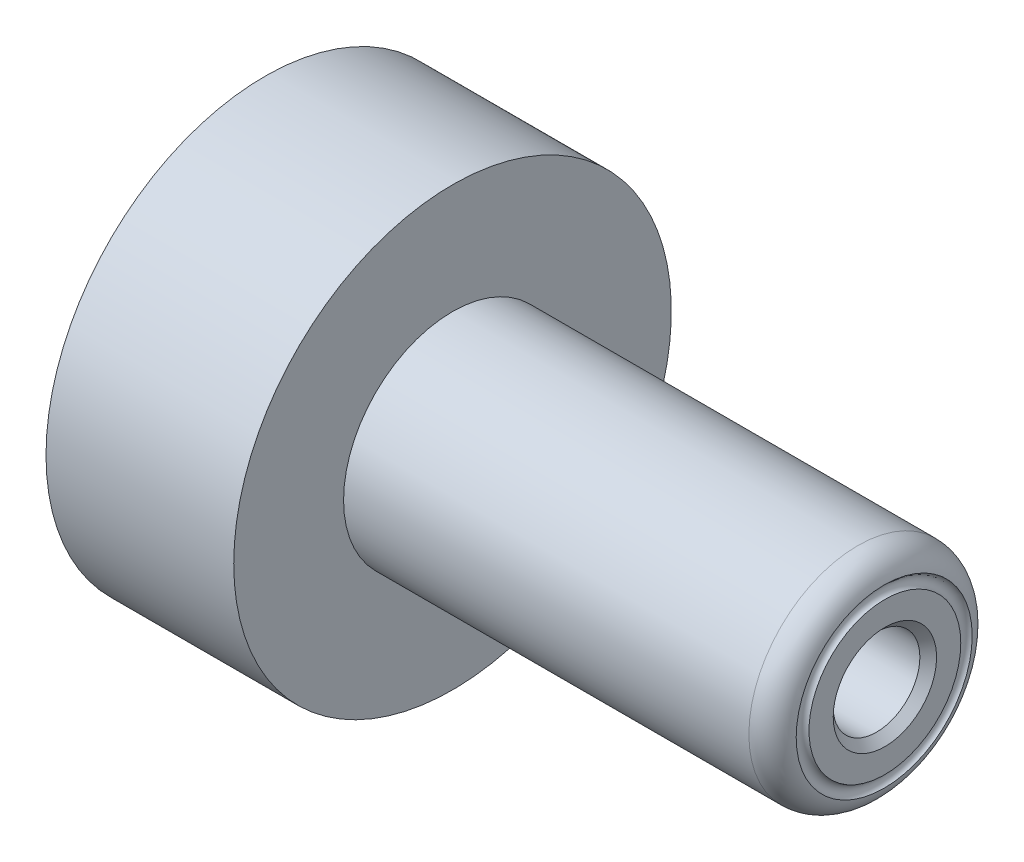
from build123d import *

# Parameters (mm, degrees)
SKETCH2_R          = 1.6129
CUT_EXTRUDE1_DEPTH = 6.35
SKETCH3_R          = 2.515
CUT_EXTRUDE2_DEPTH = 41.224242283
CHAMFER1_SIZE      = 0.485
SKETCH4_R          = 0.381


with BuildPart() as part:
    # Sketch1 → Revolve1 (revolve)
    with BuildSketch(Plane.XY, mode=Mode.PRIVATE) as revolve1_sk:
        with BuildLine():
            Line((0, 3.9751), (0, 12.7))
            Line((0, 12.7), (10.8966, 12.7))
            Line((10.8966, 12.7), (10.8966, 6.3246))
            Line((10.8966, 6.3246), (34.4218, 6.3246))
            ThreePointArc((34.4218, 6.3246), (35.531957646, 5.864757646), (35.9918, 4.7546))
            Line((35.9918, 4.7546), (35.9918, 0))
            Line((35.9918, 0), (21.8948, 0))
            Line((21.8948, 0), (21.8948, 3.9751))
            Line((21.8948, 3.9751), (0, 3.9751))
        make_face()
    revolve(revolve1_sk.sketch.rotate(Axis((0, 0, 0), (1, 0, 0)), 90), axis=Axis((0, 0, 0), (1, 0, 0)))

    # Sketch2 → Cut-Extrude1 (cut)
    with BuildSketch(Plane.ZY):
        with Locations((-7.1374, 0)):
            Circle(SKETCH2_R)
        with Locations(Location((7.1374, 0, 0), (0, 0, 180))):
            Circle(SKETCH2_R)
    extrude(amount=-CUT_EXTRUDE1_DEPTH, mode=Mode.SUBTRACT)

    # Sketch3 → Cut-Extrude2 (cut, through all)
    with BuildSketch(Plane(origin=(35.9918, 0, 0), x_dir=(0, 0, -1), z_dir=(1, 0, 0))):
        Circle(SKETCH3_R)
    extrude(amount=-CUT_EXTRUDE2_DEPTH, mode=Mode.SUBTRACT)

    # Chamfer1
    chamfer1_edges = [part.edges().sort_by_distance(p)[0] for p in [
        (35.9918, 0, 2.515),
    ]]
    chamfer(chamfer1_edges, length=CHAMFER1_SIZE)

    # Sketch4 → Cut-Revolve1 (revolve, cut)
    with BuildSketch(Plane.XY, mode=Mode.PRIVATE) as cut_revolve1_sk:
        with Locations((36.117, 4.765)):
            Circle(SKETCH4_R)
    revolve(cut_revolve1_sk.sketch.rotate(Axis((0, 0, 0), (1, 0, 0)), 90), axis=Axis((0, 0, 0), (1, 0, 0)), mode=Mode.SUBTRACT)


solid = part.part
